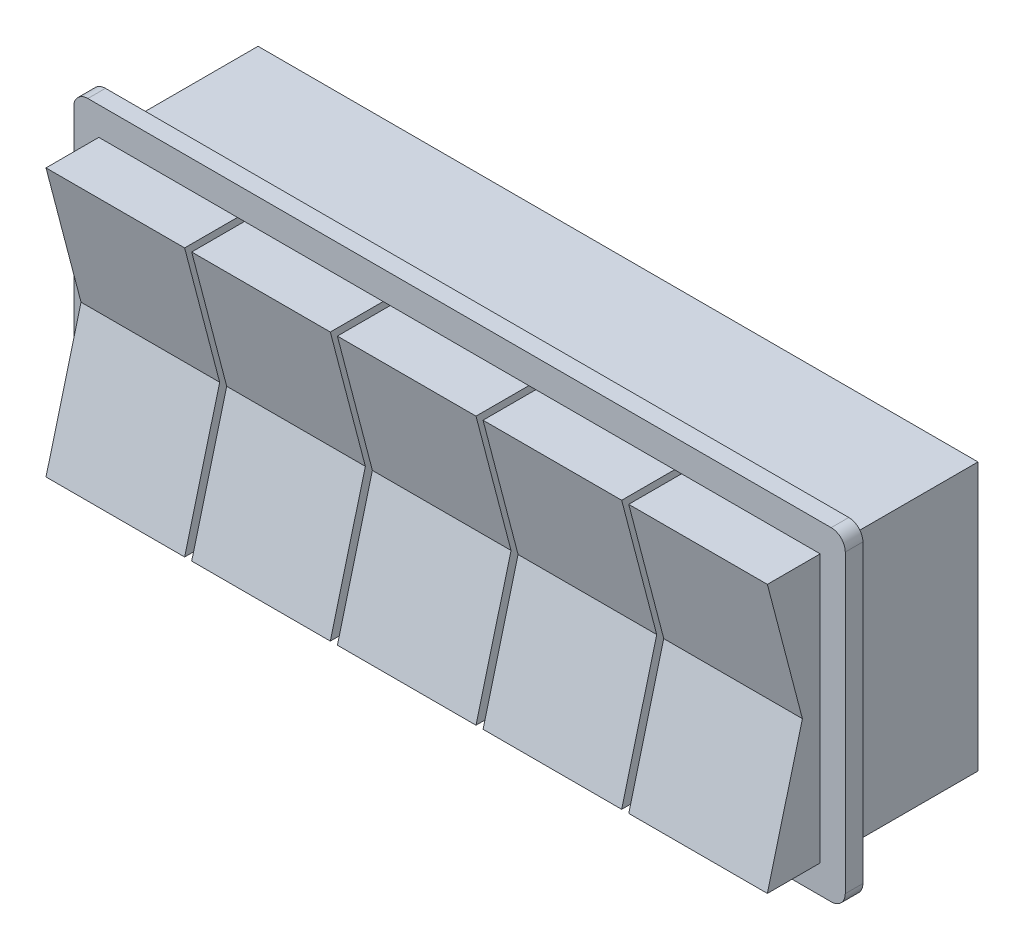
from build123d import *

# Parameters (mm, degrees)
SKETCH1_W             = 129.794
SKETCH1_H             = 48.26
BOSS_EXTRUDE1_DEPTH   = 25.4
SKETCH2_W             = 129.794
SKETCH2_H             = 48.26
BOSS_EXTRUDE2_DEPTH   = 3.175
SKETCH3_W             = 24.9936
SKETCH3_H             = 48.26
BOSS_EXTRUDE5_DEPTH   = 12.7
BOSS_EXTRUDE5_2_DEPTH = 12.7
BOSS_EXTRUDE5_3_DEPTH = 12.7
BOSS_EXTRUDE5_4_DEPTH = 12.7
BOSS_EXTRUDE5_5_DEPTH = 12.7
CUT_EXTRUDE1_DEPTH    = 254


with BuildPart() as part:
    # Sketch1 → Boss-Extrude1 (new body)
    with BuildSketch(Plane.XY):
        Rectangle(SKETCH1_W, SKETCH1_H)
    extrude(amount=BOSS_EXTRUDE1_DEPTH)


with BuildPart() as body_2:
    # Sketch2 → Boss-Extrude2 (new body)
    with BuildSketch(Plane.XY.offset(25.4)):
        with BuildLine():
            Line((-67.0052, -29.21), (67.0052, -29.21))
            ThreePointArc((67.0052, -29.21), (68.801251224, -28.466051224), (69.5452, -26.67))
            Line((69.5452, -26.67), (69.5452, 26.67))
            ThreePointArc((69.5452, 26.67), (68.801251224, 28.466051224), (67.0052, 29.21))
            Line((67.0052, 29.21), (-67.0052, 29.21))
            ThreePointArc((-67.0052, 29.21), (-68.801251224, 28.466051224), (-69.5452, 26.67))
            Line((-69.5452, 26.67), (-69.5452, -26.67))
            ThreePointArc((-69.5452, -26.67), (-68.801251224, -28.466051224), (-67.0052, -29.21))
        make_face()
        Rectangle(SKETCH2_W, SKETCH2_H, mode=Mode.SUBTRACT)
    extrude(amount=BOSS_EXTRUDE2_DEPTH)


with BuildPart() as body_3:
    # Sketch3 → Boss-Extrude5 (new body)
    with BuildSketch(Plane.XY.offset(25.4)):
        Rectangle(SKETCH3_W, SKETCH3_H)
    extrude(amount=BOSS_EXTRUDE5_DEPTH)


with BuildPart() as body_4:
    # Sketch3 → Boss-Extrude5 2 (new body)
    with BuildSketch(Plane.XY.offset(25.4)):
        with Locations((26.2636, 0)):
            Rectangle(SKETCH3_W, SKETCH3_H)
    extrude(amount=BOSS_EXTRUDE5_2_DEPTH)


with BuildPart() as body_5:
    # Sketch3 → Boss-Extrude5 3 (new body)
    with BuildSketch(Plane.XY.offset(25.4)):
        with Locations((52.5272, 0)):
            Rectangle(SKETCH3_W, SKETCH3_H)
    extrude(amount=BOSS_EXTRUDE5_3_DEPTH)


with BuildPart() as body_6:
    # Sketch3 → Boss-Extrude5 4 (new body)
    with BuildSketch(Plane.XY.offset(25.4)):
        with Locations((-26.2636, 0)):
            Rectangle(SKETCH3_W, SKETCH3_H)
    extrude(amount=BOSS_EXTRUDE5_4_DEPTH)


with BuildPart() as body_7:
    # Sketch3 → Boss-Extrude5 5 (new body)
    with BuildSketch(Plane.XY.offset(25.4)):
        with Locations((-52.5272, 0)):
            Rectangle(SKETCH3_W, SKETCH3_H)
    extrude(amount=BOSS_EXTRUDE5_5_DEPTH)


with BuildPart() as cut_extrude1_tool:
    # Sketch4 → Cut-Extrude1 (new body)
    with BuildSketch(Plane.ZY.offset(65.024)):
        Polygon((38.1, 24.13), (38.1, -24.13), (31.784037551, 0), align=None)
    extrude(amount=-CUT_EXTRUDE1_DEPTH)


with BuildPart() as body_3_1:
    add(body_3.part)

    # Cut-Extrude1: cut by cut_extrude1_tool
    add(cut_extrude1_tool.part, mode=Mode.SUBTRACT)


with BuildPart() as body_4_1:
    add(body_4.part)

    # Cut-Extrude1: cut by cut_extrude1_tool
    add(cut_extrude1_tool.part, mode=Mode.SUBTRACT)


with BuildPart() as body_5_1:
    add(body_5.part)

    # Cut-Extrude1: cut by cut_extrude1_tool
    add(cut_extrude1_tool.part, mode=Mode.SUBTRACT)


with BuildPart() as body_6_1:
    add(body_6.part)

    # Cut-Extrude1: cut by cut_extrude1_tool
    add(cut_extrude1_tool.part, mode=Mode.SUBTRACT)


with BuildPart() as body_7_1:
    add(body_7.part)

    # Cut-Extrude1: cut by cut_extrude1_tool
    add(cut_extrude1_tool.part, mode=Mode.SUBTRACT)


solid = Compound([part.part, body_2.part, body_3_1.part, body_4_1.part, body_5_1.part, body_6_1.part, body_7_1.part])
